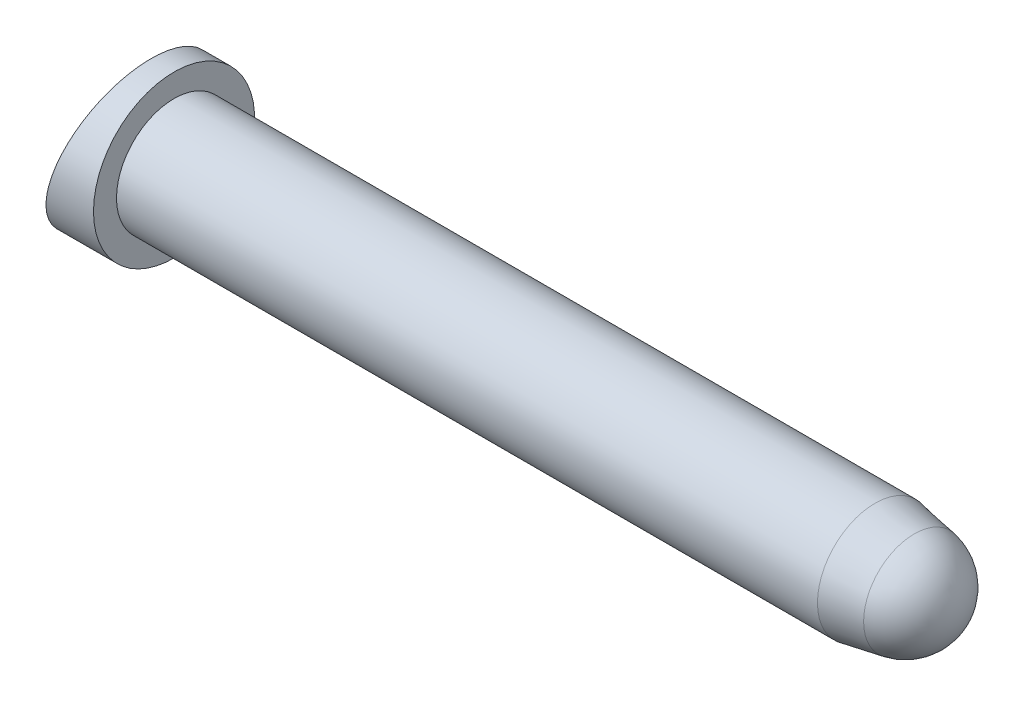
ISO-10303-21;
HEADER;
FILE_DESCRIPTION(('STEP AP214'),'2;1');
FILE_NAME('part.step','',(''),(''),'','','');
FILE_SCHEMA(('AUTOMOTIVE_DESIGN { 1 0 10303 214 1 1 1 1 }'));
ENDSEC;
DATA;
#1=APPLICATION_CONTEXT('core data for automotive mechanical design processes');
#2=APPLICATION_PROTOCOL_DEFINITION('international standard','automotive_design',2000,#1);
#3=PRODUCT_CONTEXT('',#1,'mechanical');
#4=PRODUCT('Part','Part','',(#3));
#5=PRODUCT_RELATED_PRODUCT_CATEGORY('part','',(#4));
#6=PRODUCT_DEFINITION_FORMATION('','',#4);
#7=PRODUCT_DEFINITION_CONTEXT('part definition',#1,'design');
#8=PRODUCT_DEFINITION('design','',#6,#7);
#9=PRODUCT_DEFINITION_SHAPE('','',#8);
#10=(LENGTH_UNIT() NAMED_UNIT(*) SI_UNIT(.MILLI.,.METRE.));
#11=(NAMED_UNIT(*) PLANE_ANGLE_UNIT() SI_UNIT($,.RADIAN.));
#12=(NAMED_UNIT(*) SI_UNIT($,.STERADIAN.) SOLID_ANGLE_UNIT());
#13=UNCERTAINTY_MEASURE_WITH_UNIT(LENGTH_MEASURE(1.E-05),#10,'distance_accuracy_value','');
#14=(GEOMETRIC_REPRESENTATION_CONTEXT(3) GLOBAL_UNCERTAINTY_ASSIGNED_CONTEXT((#13)) GLOBAL_UNIT_ASSIGNED_CONTEXT((#10,
#11,#12)) REPRESENTATION_CONTEXT('',''));
#15=CARTESIAN_POINT('',(0.,0.,0.));
#16=DIRECTION('',(0.,0.,1.));
#17=DIRECTION('',(1.,0.,0.));
#18=AXIS2_PLACEMENT_3D('',#15,#16,#17);
#19=CARTESIAN_POINT('',(0.,0.,0.));
#20=DIRECTION('',(-1.,0.,0.));
#21=DIRECTION('',(0.,0.,1.));
#22=AXIS2_PLACEMENT_3D('',#19,#20,#21);
#23=CYLINDRICAL_SURFACE('',#22,7.);
#24=CARTESIAN_POINT('',(12.,0.,0.));
#25=DIRECTION('',(-1.,0.,0.));
#26=DIRECTION('',(0.,0.,1.));
#27=AXIS2_PLACEMENT_3D('',#24,#25,#26);
#28=CIRCLE('',#27,7.);
#29=CARTESIAN_POINT('',(12.,0.,7.));
#30=VERTEX_POINT('',#29);
#31=EDGE_CURVE('E39',#30,#30,#28,.T.);
#32=ORIENTED_EDGE('',*,*,#31,.T.);
#33=EDGE_LOOP('',(#32));
#34=FACE_BOUND('',#33,.T.);
#35=CARTESIAN_POINT('',(8.12000000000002,0.,0.));
#36=DIRECTION('',(-0.96592582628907,0.258819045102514,0.));
#37=DIRECTION('',(-0.258819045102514,-0.96592582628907,0.));
#38=AXIS2_PLACEMENT_3D('',#35,#36,#37);
#39=ELLIPSE('',#38,7.24693326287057,7.);
#40=CARTESIAN_POINT('',(6.24435565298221,-7.00000000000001,0.));
#41=VERTEX_POINT('',#40);
#42=EDGE_CURVE('E10',#41,#41,#39,.T.);
#43=ORIENTED_EDGE('',*,*,#42,.F.);
#44=EDGE_LOOP('',(#43));
#45=FACE_BOUND('',#44,.T.);
#46=ADVANCED_FACE('F28',(#34,#45),#23,.T.);
#47=CARTESIAN_POINT('',(72.9,0.,0.));
#48=DIRECTION('',(-1.,0.,0.));
#49=DIRECTION('',(0.,0.,1.));
#50=AXIS2_PLACEMENT_3D('',#47,#48,#49);
#51=CONICAL_SURFACE('',#50,5.,0.174532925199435);
#52=CARTESIAN_POINT('',(76.3088632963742,0.,0.));
#53=DIRECTION('',(-1.,0.,0.));
#54=DIRECTION('',(0.,0.,1.));
#55=AXIS2_PLACEMENT_3D('',#52,#53,#54);
#56=CIRCLE('',#55,4.39892542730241);
#57=CARTESIAN_POINT('',(76.3088632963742,0.,4.39892542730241));
#58=VERTEX_POINT('',#57);
#59=EDGE_CURVE('E35',#58,#58,#56,.T.);
#60=CARTESIAN_POINT('',(72.9,0.,0.));
#61=DIRECTION('',(-1.,0.,0.));
#62=DIRECTION('',(0.,0.,1.));
#63=AXIS2_PLACEMENT_3D('',#60,#61,#62);
#64=CIRCLE('',#63,5.);
#65=CARTESIAN_POINT('',(72.9,0.,5.));
#66=VERTEX_POINT('',#65);
#67=EDGE_CURVE('E48',#66,#66,#64,.T.);
#68=CARTESIAN_POINT('',(76.3088632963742,0.,4.39892542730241));
#69=CARTESIAN_POINT('',(76.2733543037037,0.,4.40518662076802));
#70=CARTESIAN_POINT('',(76.2378453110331,0.,4.41144781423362));
#71=CARTESIAN_POINT('',(76.166827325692,0.,4.42397020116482));
#72=CARTESIAN_POINT('',(76.1313183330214,0.,4.43023139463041));
#73=CARTESIAN_POINT('',(76.0603003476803,0.,4.44275378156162));
#74=CARTESIAN_POINT('',(76.0247913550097,0.,4.44901497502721));
#75=CARTESIAN_POINT('',(75.9537733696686,0.,4.46153736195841));
#76=CARTESIAN_POINT('',(75.918264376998,0.,4.46779855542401));
#77=CARTESIAN_POINT('',(75.8472463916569,0.,4.48032094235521));
#78=CARTESIAN_POINT('',(75.8117373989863,0.,4.48658213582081));
#79=CARTESIAN_POINT('',(75.7407194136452,0.,4.49910452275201));
#80=CARTESIAN_POINT('',(75.7052104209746,0.,4.50536571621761));
#81=CARTESIAN_POINT('',(75.6341924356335,0.,4.51788810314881));
#82=CARTESIAN_POINT('',(75.5986834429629,0.,4.52414929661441));
#83=CARTESIAN_POINT('',(75.5276654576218,0.,4.53667168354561));
#84=CARTESIAN_POINT('',(75.4921564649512,0.,4.54293287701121));
#85=CARTESIAN_POINT('',(75.4211384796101,0.,4.55545526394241));
#86=CARTESIAN_POINT('',(75.3856294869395,0.,4.56171645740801));
#87=CARTESIAN_POINT('',(75.3146115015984,0.,4.57423884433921));
#88=CARTESIAN_POINT('',(75.2791025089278,0.,4.58050003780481));
#89=CARTESIAN_POINT('',(75.2080845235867,0.,4.59302242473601));
#90=CARTESIAN_POINT('',(75.1725755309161,0.,4.59928361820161));
#91=CARTESIAN_POINT('',(75.101557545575,0.,4.61180600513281));
#92=CARTESIAN_POINT('',(75.0660485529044,0.,4.61806719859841));
#93=CARTESIAN_POINT('',(74.9950305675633,0.,4.63058958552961));
#94=CARTESIAN_POINT('',(74.9595215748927,0.,4.63685077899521));
#95=CARTESIAN_POINT('',(74.8885035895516,0.,4.64937316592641));
#96=CARTESIAN_POINT('',(74.852994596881,0.,4.65563435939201));
#97=CARTESIAN_POINT('',(74.7819766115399,0.,4.66815674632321));
#98=CARTESIAN_POINT('',(74.7464676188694,0.,4.67441793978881));
#99=CARTESIAN_POINT('',(74.6754496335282,0.,4.68694032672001));
#100=CARTESIAN_POINT('',(74.6399406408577,0.,4.69320152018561));
#101=CARTESIAN_POINT('',(74.5689226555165,0.,4.70572390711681));
#102=CARTESIAN_POINT('',(74.533413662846,0.,4.71198510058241));
#103=CARTESIAN_POINT('',(74.4623956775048,0.,4.72450748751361));
#104=CARTESIAN_POINT('',(74.4268866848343,0.,4.73076868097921));
#105=CARTESIAN_POINT('',(74.3558686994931,0.,4.74329106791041));
#106=CARTESIAN_POINT('',(74.3203597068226,0.,4.74955226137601));
#107=CARTESIAN_POINT('',(74.2493417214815,0.,4.76207464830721));
#108=CARTESIAN_POINT('',(74.2138327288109,0.,4.76833584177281));
#109=CARTESIAN_POINT('',(74.1428147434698,0.,4.78085822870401));
#110=CARTESIAN_POINT('',(74.1073057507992,0.,4.7871194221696));
#111=CARTESIAN_POINT('',(74.0362877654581,0.,4.79964180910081));
#112=CARTESIAN_POINT('',(74.0007787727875,0.,4.8059030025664));
#113=CARTESIAN_POINT('',(73.9297607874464,0.,4.8184253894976));
#114=CARTESIAN_POINT('',(73.8942517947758,0.,4.8246865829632));
#115=CARTESIAN_POINT('',(73.8232338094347,0.,4.8372089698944));
#116=CARTESIAN_POINT('',(73.7877248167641,0.,4.84347016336));
#117=CARTESIAN_POINT('',(73.716706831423,0.,4.8559925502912));
#118=CARTESIAN_POINT('',(73.6811978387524,0.,4.8622537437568));
#119=CARTESIAN_POINT('',(73.6101798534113,0.,4.874776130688));
#120=CARTESIAN_POINT('',(73.5746708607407,0.,4.8810373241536));
#121=CARTESIAN_POINT('',(73.5036528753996,0.,4.8935597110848));
#122=CARTESIAN_POINT('',(73.468143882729,0.,4.8998209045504));
#123=CARTESIAN_POINT('',(73.3971258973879,0.,4.9123432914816));
#124=CARTESIAN_POINT('',(73.3616169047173,0.,4.9186044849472));
#125=CARTESIAN_POINT('',(73.2905989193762,0.,4.9311268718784));
#126=CARTESIAN_POINT('',(73.2550899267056,0.,4.937388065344));
#127=CARTESIAN_POINT('',(73.1840719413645,0.,4.9499104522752));
#128=CARTESIAN_POINT('',(73.1485629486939,0.,4.9561716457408));
#129=CARTESIAN_POINT('',(73.0775449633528,0.,4.968694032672));
#130=CARTESIAN_POINT('',(73.0420359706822,0.,4.9749552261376));
#131=CARTESIAN_POINT('',(72.9710179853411,0.,4.9874776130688));
#132=CARTESIAN_POINT('',(72.9355089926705,0.,4.9937388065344));
#133=CARTESIAN_POINT('',(72.9,0.,5.));
#134=B_SPLINE_CURVE_WITH_KNOTS('',3,(#68,#69,#70,#71,#72,#73,#74,#75,#76,#77,#78,#79,#80,#81,
#82,#83,#84,#85,#86,#87,#88,#89,#90,#91,#92,#93,#94,#95,#96,#97,#98,#99,#100,#101,#102,#103,
#104,#105,#106,#107,#108,#109,#110,#111,#112,#113,#114,#115,#116,#117,#118,#119,#120,#121,#122,
#123,#124,#125,#126,#127,#128,#129,#130,#131,#132,#133),.UNSPECIFIED.,.F.,.F.,(4,2,2,2,2,2,2,2,
2,2,2,2,2,2,2,2,2,2,2,2,2,2,2,2,2,2,2,2,2,2,2,2,4),(0.,0.108170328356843,0.216340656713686,
0.324510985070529,0.432681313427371,0.540851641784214,0.649021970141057,0.7571922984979,
0.865362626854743,0.973532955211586,1.08170328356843,1.18987361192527,1.29804394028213,
1.40621426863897,1.5143845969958,1.62255492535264,1.73072525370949,1.83889558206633,
1.94706591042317,2.05523623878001,2.16340656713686,2.2715768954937,2.37974722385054,
2.48791755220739,2.59608788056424,2.70425820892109,2.81242853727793,2.92059886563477,
3.02876919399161,3.13693952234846,3.2451098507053,3.35328017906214,3.46145050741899),.UNSPECIFIED.);
#135=EDGE_CURVE('BSEAM30',#58,#66,#134,.T.);
#136=ORIENTED_EDGE('',*,*,#59,.T.);
#137=ORIENTED_EDGE('',*,*,#67,.F.);
#138=ORIENTED_EDGE('',*,*,#135,.T.);
#139=ORIENTED_EDGE('',*,*,#135,.F.);
#140=EDGE_LOOP('',(#136,#138,#137,#139));
#141=FACE_BOUND('',#140,.T.);
#142=ADVANCED_FACE('F30',(#141),#51,.T.);
#143=CARTESIAN_POINT('',(75.5332140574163,0.,0.));
#144=DIRECTION('',(-1.,0.,0.));
#145=DIRECTION('',(0.,1.,0.));
#146=AXIS2_PLACEMENT_3D('',#143,#144,#145);
#147=SPHERICAL_SURFACE('',#146,4.46678594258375);
#148=ORIENTED_EDGE('',*,*,#59,.F.);
#149=EDGE_LOOP('',(#148));
#150=FACE_BOUND('',#149,.T.);
#151=ADVANCED_FACE('F55',(#150),#147,.T.);
#152=CARTESIAN_POINT('',(12.,4.99999999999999,0.));
#153=DIRECTION('',(-1.,0.,0.));
#154=DIRECTION('',(0.,0.,1.));
#155=AXIS2_PLACEMENT_3D('',#152,#153,#154);
#156=PLANE('',#155);
#157=ORIENTED_EDGE('',*,*,#31,.F.);
#158=EDGE_LOOP('',(#157));
#159=FACE_BOUND('',#158,.T.);
#160=CARTESIAN_POINT('',(12.,0.,0.));
#161=DIRECTION('',(-1.,0.,0.));
#162=DIRECTION('',(0.,0.,1.));
#163=AXIS2_PLACEMENT_3D('',#160,#161,#162);
#164=CIRCLE('',#163,5.);
#165=CARTESIAN_POINT('',(12.,0.,5.));
#166=VERTEX_POINT('',#165);
#167=EDGE_CURVE('E43',#166,#166,#164,.T.);
#168=ORIENTED_EDGE('',*,*,#167,.T.);
#169=EDGE_LOOP('',(#168));
#170=FACE_BOUND('',#169,.T.);
#171=ADVANCED_FACE('F60',(#159,#170),#156,.F.);
#172=CARTESIAN_POINT('',(0.,0.,0.));
#173=DIRECTION('',(-1.,0.,0.));
#174=DIRECTION('',(0.,0.,1.));
#175=AXIS2_PLACEMENT_3D('',#172,#173,#174);
#176=CYLINDRICAL_SURFACE('',#175,5.);
#177=CARTESIAN_POINT('',(12.,0.,5.));
#178=CARTESIAN_POINT('',(12.634375,0.,5.));
#179=CARTESIAN_POINT('',(13.26875,0.,5.));
#180=CARTESIAN_POINT('',(14.5375,0.,5.));
#181=CARTESIAN_POINT('',(15.171875,0.,5.));
#182=CARTESIAN_POINT('',(16.440625,0.,5.));
#183=CARTESIAN_POINT('',(17.075,0.,5.));
#184=CARTESIAN_POINT('',(18.34375,0.,5.));
#185=CARTESIAN_POINT('',(18.978125,0.,5.));
#186=CARTESIAN_POINT('',(20.246875,0.,5.));
#187=CARTESIAN_POINT('',(20.88125,0.,5.));
#188=CARTESIAN_POINT('',(22.15,0.,5.));
#189=CARTESIAN_POINT('',(22.784375,0.,5.));
#190=CARTESIAN_POINT('',(24.053125,0.,5.));
#191=CARTESIAN_POINT('',(24.6875,0.,5.));
#192=CARTESIAN_POINT('',(25.95625,0.,5.));
#193=CARTESIAN_POINT('',(26.590625,0.,5.));
#194=CARTESIAN_POINT('',(27.859375,0.,5.));
#195=CARTESIAN_POINT('',(28.49375,0.,5.));
#196=CARTESIAN_POINT('',(29.7625,0.,5.));
#197=CARTESIAN_POINT('',(30.396875,0.,5.));
#198=CARTESIAN_POINT('',(31.665625,0.,5.));
#199=CARTESIAN_POINT('',(32.3,0.,5.));
#200=CARTESIAN_POINT('',(33.56875,0.,5.));
#201=CARTESIAN_POINT('',(34.203125,0.,5.));
#202=CARTESIAN_POINT('',(35.471875,0.,5.));
#203=CARTESIAN_POINT('',(36.10625,0.,5.));
#204=CARTESIAN_POINT('',(37.375,0.,5.));
#205=CARTESIAN_POINT('',(38.009375,0.,5.));
#206=CARTESIAN_POINT('',(39.278125,0.,5.));
#207=CARTESIAN_POINT('',(39.9125,0.,5.));
#208=CARTESIAN_POINT('',(41.18125,0.,5.));
#209=CARTESIAN_POINT('',(41.815625,0.,5.));
#210=CARTESIAN_POINT('',(43.084375,0.,5.));
#211=CARTESIAN_POINT('',(43.71875,0.,5.));
#212=CARTESIAN_POINT('',(44.9875,0.,5.));
#213=CARTESIAN_POINT('',(45.621875,0.,5.));
#214=CARTESIAN_POINT('',(46.890625,0.,5.));
#215=CARTESIAN_POINT('',(47.525,0.,5.));
#216=CARTESIAN_POINT('',(48.79375,0.,5.));
#217=CARTESIAN_POINT('',(49.428125,0.,5.));
#218=CARTESIAN_POINT('',(50.696875,0.,5.));
#219=CARTESIAN_POINT('',(51.33125,0.,5.));
#220=CARTESIAN_POINT('',(52.6,0.,5.));
#221=CARTESIAN_POINT('',(53.234375,0.,5.));
#222=CARTESIAN_POINT('',(54.503125,0.,5.));
#223=CARTESIAN_POINT('',(55.1375,0.,5.));
#224=CARTESIAN_POINT('',(56.40625,0.,5.));
#225=CARTESIAN_POINT('',(57.040625,0.,5.));
#226=CARTESIAN_POINT('',(58.309375,0.,5.));
#227=CARTESIAN_POINT('',(58.94375,0.,5.));
#228=CARTESIAN_POINT('',(60.2125,0.,5.));
#229=CARTESIAN_POINT('',(60.846875,0.,5.));
#230=CARTESIAN_POINT('',(62.115625,0.,5.));
#231=CARTESIAN_POINT('',(62.75,0.,5.));
#232=CARTESIAN_POINT('',(64.01875,0.,5.));
#233=CARTESIAN_POINT('',(64.653125,0.,5.));
#234=CARTESIAN_POINT('',(65.921875,0.,5.));
#235=CARTESIAN_POINT('',(66.55625,0.,5.));
#236=CARTESIAN_POINT('',(67.825,0.,5.));
#237=CARTESIAN_POINT('',(68.459375,0.,5.));
#238=CARTESIAN_POINT('',(69.728125,0.,5.));
#239=CARTESIAN_POINT('',(70.3625,0.,5.));
#240=CARTESIAN_POINT('',(71.63125,0.,5.));
#241=CARTESIAN_POINT('',(72.265625,0.,5.));
#242=CARTESIAN_POINT('',(72.9,0.,5.));
#243=B_SPLINE_CURVE_WITH_KNOTS('',3,(#177,#178,#179,#180,#181,#182,#183,#184,#185,#186,#187,
#188,#189,#190,#191,#192,#193,#194,#195,#196,#197,#198,#199,#200,#201,#202,#203,#204,#205,#206,
#207,#208,#209,#210,#211,#212,#213,#214,#215,#216,#217,#218,#219,#220,#221,#222,#223,#224,#225,
#226,#227,#228,#229,#230,#231,#232,#233,#234,#235,#236,#237,#238,#239,#240,#241,#242),
.UNSPECIFIED.,.F.,.F.,(4,2,2,2,2,2,2,2,2,2,2,2,2,2,2,2,2,2,2,2,2,2,2,2,2,2,2,2,2,2,2,2,4),(0.,
1.903125,3.80625,5.709375,7.6125,9.51562499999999,11.41875,13.321875,15.225,17.128125,19.03125,
20.934375,22.8375,24.740625,26.64375,28.546875,30.45,32.353125,34.25625,36.159375,38.0625,
39.965625,41.86875,43.771875,45.675,47.578125,49.48125,51.384375,53.2875,55.190625,57.09375,
58.996875,60.9),.UNSPECIFIED.);
#244=EDGE_CURVE('BSEAM52',#166,#66,#243,.T.);
#245=ORIENTED_EDGE('',*,*,#167,.F.);
#246=ORIENTED_EDGE('',*,*,#67,.T.);
#247=ORIENTED_EDGE('',*,*,#244,.T.);
#248=ORIENTED_EDGE('',*,*,#244,.F.);
#249=EDGE_LOOP('',(#245,#247,#246,#248));
#250=FACE_BOUND('',#249,.T.);
#251=ADVANCED_FACE('F52',(#250),#176,.T.);
#252=CARTESIAN_POINT('',(10.3450741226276,8.30408967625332,-6.99999999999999));
#253=DIRECTION('',(-0.96592582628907,0.258819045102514,0.));
#254=DIRECTION('',(-0.258819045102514,-0.96592582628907,0.));
#255=AXIS2_PLACEMENT_3D('',#252,#253,#254);
#256=PLANE('',#255);
#257=ORIENTED_EDGE('',*,*,#42,.T.);
#258=EDGE_LOOP('',(#257));
#259=FACE_BOUND('',#258,.T.);
#260=ADVANCED_FACE('F73',(#259),#256,.T.);
#261=CLOSED_SHELL('',(#46,#142,#151,#171,#251,#260));
#262=MANIFOLD_SOLID_BREP('B2',#261);
#263=ADVANCED_BREP_SHAPE_REPRESENTATION('',(#18,#262),#14);
#264=SHAPE_DEFINITION_REPRESENTATION(#9,#263);
ENDSEC;
END-ISO-10303-21;
